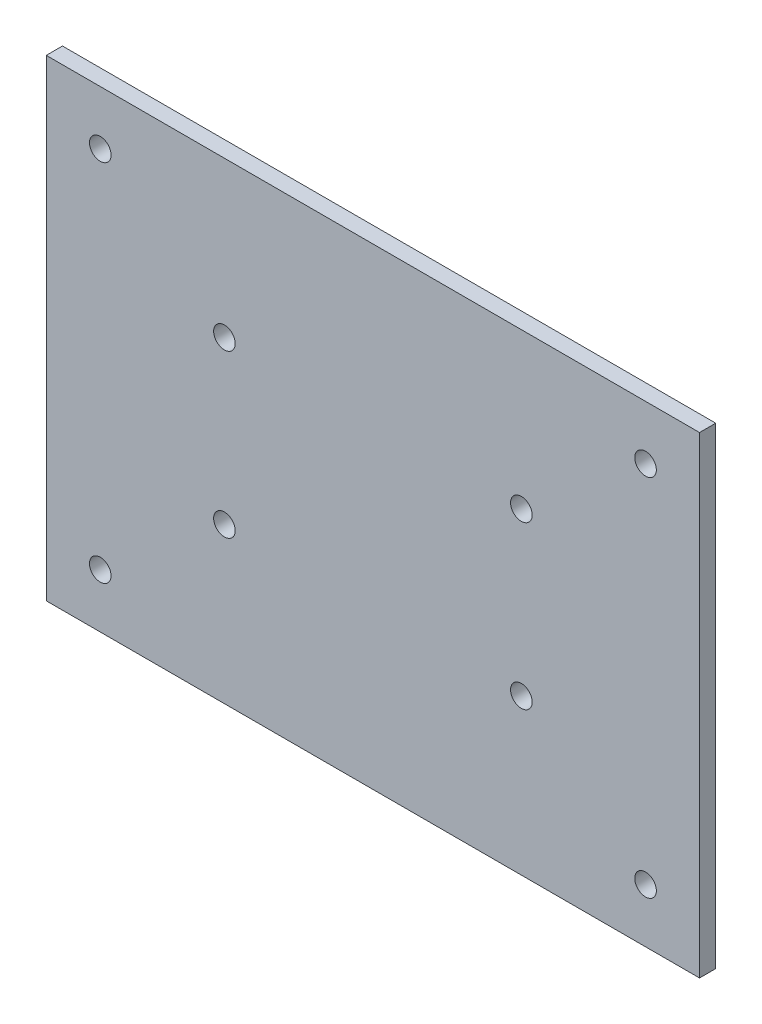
ISO-10303-21;
HEADER;
FILE_DESCRIPTION(('STEP AP214'),'2;1');
FILE_NAME('part.step','',(''),(''),'','','');
FILE_SCHEMA(('AUTOMOTIVE_DESIGN { 1 0 10303 214 1 1 1 1 }'));
ENDSEC;
DATA;
#1=APPLICATION_CONTEXT('core data for automotive mechanical design processes');
#2=APPLICATION_PROTOCOL_DEFINITION('international standard','automotive_design',2000,#1);
#3=PRODUCT_CONTEXT('',#1,'mechanical');
#4=PRODUCT('Part','Part','',(#3));
#5=PRODUCT_RELATED_PRODUCT_CATEGORY('part','',(#4));
#6=PRODUCT_DEFINITION_FORMATION('','',#4);
#7=PRODUCT_DEFINITION_CONTEXT('part definition',#1,'design');
#8=PRODUCT_DEFINITION('design','',#6,#7);
#9=PRODUCT_DEFINITION_SHAPE('','',#8);
#10=(LENGTH_UNIT() NAMED_UNIT(*) SI_UNIT(.MILLI.,.METRE.));
#11=(NAMED_UNIT(*) PLANE_ANGLE_UNIT() SI_UNIT($,.RADIAN.));
#12=(NAMED_UNIT(*) SI_UNIT($,.STERADIAN.) SOLID_ANGLE_UNIT());
#13=UNCERTAINTY_MEASURE_WITH_UNIT(LENGTH_MEASURE(1.E-05),#10,'distance_accuracy_value','');
#14=(GEOMETRIC_REPRESENTATION_CONTEXT(3) GLOBAL_UNCERTAINTY_ASSIGNED_CONTEXT((#13)) GLOBAL_UNIT_ASSIGNED_CONTEXT((#10,
#11,#12)) REPRESENTATION_CONTEXT('',''));
#15=CARTESIAN_POINT('',(0.,0.,0.));
#16=DIRECTION('',(0.,0.,1.));
#17=DIRECTION('',(1.,0.,0.));
#18=AXIS2_PLACEMENT_3D('',#15,#16,#17);
#19=CARTESIAN_POINT('',(60.5,43.75,3.));
#20=DIRECTION('',(-1.,0.,0.));
#21=DIRECTION('',(0.,-1.,0.));
#22=AXIS2_PLACEMENT_3D('',#19,#20,#21);
#23=PLANE('',#22);
#24=DIRECTION('',(0.,1.,0.));
#25=VECTOR('',#24,1.);
#26=CARTESIAN_POINT('',(60.5,43.75,0.));
#27=LINE('',#26,#25);
#28=CARTESIAN_POINT('',(60.5,-43.75,0.));
#29=VERTEX_POINT('',#28);
#30=CARTESIAN_POINT('',(60.5,43.75,0.));
#31=VERTEX_POINT('',#30);
#32=EDGE_CURVE('E98',#29,#31,#27,.T.);
#33=ORIENTED_EDGE('',*,*,#32,.T.);
#34=DIRECTION('',(0.,0.,-1.));
#35=VECTOR('',#34,1.);
#36=CARTESIAN_POINT('',(60.5,43.75,3.));
#37=LINE('',#36,#35);
#38=CARTESIAN_POINT('',(60.5,43.75,3.));
#39=VERTEX_POINT('',#38);
#40=EDGE_CURVE('E11',#39,#31,#37,.T.);
#41=ORIENTED_EDGE('',*,*,#40,.F.);
#42=DIRECTION('',(0.,1.,0.));
#43=VECTOR('',#42,1.);
#44=CARTESIAN_POINT('',(60.5,43.75,3.));
#45=LINE('',#44,#43);
#46=CARTESIAN_POINT('',(60.5,-43.75,3.));
#47=VERTEX_POINT('',#46);
#48=EDGE_CURVE('E86',#47,#39,#45,.T.);
#49=ORIENTED_EDGE('',*,*,#48,.F.);
#50=DIRECTION('',(0.,0.,-1.));
#51=VECTOR('',#50,1.);
#52=CARTESIAN_POINT('',(60.5,-43.75,3.));
#53=LINE('',#52,#51);
#54=EDGE_CURVE('E94',#47,#29,#53,.T.);
#55=ORIENTED_EDGE('',*,*,#54,.T.);
#56=EDGE_LOOP('',(#33,#41,#49,#55));
#57=FACE_BOUND('',#56,.T.);
#58=ADVANCED_FACE('F35',(#57),#23,.F.);
#59=CARTESIAN_POINT('',(-60.5,43.75,3.));
#60=DIRECTION('',(0.,-1.,0.));
#61=DIRECTION('',(0.,0.,-1.));
#62=AXIS2_PLACEMENT_3D('',#59,#60,#61);
#63=PLANE('',#62);
#64=DIRECTION('',(-1.,0.,0.));
#65=VECTOR('',#64,1.);
#66=CARTESIAN_POINT('',(-60.5,43.75,0.));
#67=LINE('',#66,#65);
#68=CARTESIAN_POINT('',(-60.5,43.75,0.));
#69=VERTEX_POINT('',#68);
#70=EDGE_CURVE('E90',#31,#69,#67,.T.);
#71=ORIENTED_EDGE('',*,*,#70,.T.);
#72=DIRECTION('',(0.,0.,-1.));
#73=VECTOR('',#72,1.);
#74=CARTESIAN_POINT('',(-60.5,43.75,3.));
#75=LINE('',#74,#73);
#76=CARTESIAN_POINT('',(-60.5,43.75,3.));
#77=VERTEX_POINT('',#76);
#78=EDGE_CURVE('E43',#77,#69,#75,.T.);
#79=ORIENTED_EDGE('',*,*,#78,.F.);
#80=DIRECTION('',(-1.,0.,0.));
#81=VECTOR('',#80,1.);
#82=CARTESIAN_POINT('',(-60.5,43.75,3.));
#83=LINE('',#82,#81);
#84=EDGE_CURVE('E81',#39,#77,#83,.T.);
#85=ORIENTED_EDGE('',*,*,#84,.F.);
#86=ORIENTED_EDGE('',*,*,#40,.T.);
#87=EDGE_LOOP('',(#71,#79,#85,#86));
#88=FACE_BOUND('',#87,.T.);
#89=ADVANCED_FACE('F89',(#88),#63,.F.);
#90=CARTESIAN_POINT('',(-60.5,43.75,3.));
#91=DIRECTION('',(1.,0.,0.));
#92=DIRECTION('',(0.,1.,0.));
#93=AXIS2_PLACEMENT_3D('',#90,#91,#92);
#94=PLANE('',#93);
#95=DIRECTION('',(0.,-1.,0.));
#96=VECTOR('',#95,1.);
#97=CARTESIAN_POINT('',(-60.5,43.75,0.));
#98=LINE('',#97,#96);
#99=CARTESIAN_POINT('',(-60.5,-43.75,0.));
#100=VERTEX_POINT('',#99);
#101=EDGE_CURVE('E68',#69,#100,#98,.T.);
#102=ORIENTED_EDGE('',*,*,#101,.T.);
#103=DIRECTION('',(0.,0.,-1.));
#104=VECTOR('',#103,1.);
#105=CARTESIAN_POINT('',(-60.5,-43.75,3.));
#106=LINE('',#105,#104);
#107=CARTESIAN_POINT('',(-60.5,-43.75,3.));
#108=VERTEX_POINT('',#107);
#109=EDGE_CURVE('E91',#108,#100,#106,.T.);
#110=ORIENTED_EDGE('',*,*,#109,.F.);
#111=DIRECTION('',(0.,-1.,0.));
#112=VECTOR('',#111,1.);
#113=CARTESIAN_POINT('',(-60.5,43.75,3.));
#114=LINE('',#113,#112);
#115=EDGE_CURVE('E84',#77,#108,#114,.T.);
#116=ORIENTED_EDGE('',*,*,#115,.F.);
#117=ORIENTED_EDGE('',*,*,#78,.T.);
#118=EDGE_LOOP('',(#102,#110,#116,#117));
#119=FACE_BOUND('',#118,.T.);
#120=ADVANCED_FACE('F92',(#119),#94,.F.);
#121=CARTESIAN_POINT('',(-60.5,-43.75,3.));
#122=DIRECTION('',(0.,1.,0.));
#123=DIRECTION('',(0.,0.,1.));
#124=AXIS2_PLACEMENT_3D('',#121,#122,#123);
#125=PLANE('',#124);
#126=DIRECTION('',(1.,0.,0.));
#127=VECTOR('',#126,1.);
#128=CARTESIAN_POINT('',(-60.5,-43.75,0.));
#129=LINE('',#128,#127);
#130=EDGE_CURVE('E74',#100,#29,#129,.T.);
#131=ORIENTED_EDGE('',*,*,#130,.T.);
#132=ORIENTED_EDGE('',*,*,#54,.F.);
#133=DIRECTION('',(1.,0.,0.));
#134=VECTOR('',#133,1.);
#135=CARTESIAN_POINT('',(-60.5,-43.75,3.));
#136=LINE('',#135,#134);
#137=EDGE_CURVE('E51',#108,#47,#136,.T.);
#138=ORIENTED_EDGE('',*,*,#137,.F.);
#139=ORIENTED_EDGE('',*,*,#109,.T.);
#140=EDGE_LOOP('',(#131,#132,#138,#139));
#141=FACE_BOUND('',#140,.T.);
#142=ADVANCED_FACE('F106',(#141),#125,.F.);
#143=CARTESIAN_POINT('',(0.,0.,3.));
#144=DIRECTION('',(0.,0.,1.));
#145=DIRECTION('',(1.,0.,0.));
#146=AXIS2_PLACEMENT_3D('',#143,#144,#145);
#147=PLANE('',#146);
#148=CARTESIAN_POINT('',(-50.5,33.75,3.));
#149=DIRECTION('',(0.,0.,1.));
#150=DIRECTION('',(1.,0.,0.));
#151=AXIS2_PLACEMENT_3D('',#148,#149,#150);
#152=CIRCLE('',#151,1.99999999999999);
#153=CARTESIAN_POINT('',(-48.5,33.75,3.));
#154=VERTEX_POINT('',#153);
#155=EDGE_CURVE('E156',#154,#154,#152,.T.);
#156=ORIENTED_EDGE('',*,*,#155,.F.);
#157=EDGE_LOOP('',(#156));
#158=FACE_BOUND('',#157,.T.);
#159=CARTESIAN_POINT('',(-50.5,-33.75,3.));
#160=DIRECTION('',(0.,0.,1.));
#161=DIRECTION('',(1.,0.,0.));
#162=AXIS2_PLACEMENT_3D('',#159,#160,#161);
#163=CIRCLE('',#162,1.99999999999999);
#164=CARTESIAN_POINT('',(-48.5,-33.75,3.));
#165=VERTEX_POINT('',#164);
#166=EDGE_CURVE('E150',#165,#165,#163,.T.);
#167=ORIENTED_EDGE('',*,*,#166,.F.);
#168=EDGE_LOOP('',(#167));
#169=FACE_BOUND('',#168,.T.);
#170=CARTESIAN_POINT('',(50.5,33.75,3.));
#171=DIRECTION('',(0.,0.,1.));
#172=DIRECTION('',(1.,0.,0.));
#173=AXIS2_PLACEMENT_3D('',#170,#171,#172);
#174=CIRCLE('',#173,1.99999999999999);
#175=CARTESIAN_POINT('',(52.5,33.75,3.));
#176=VERTEX_POINT('',#175);
#177=EDGE_CURVE('E144',#176,#176,#174,.T.);
#178=ORIENTED_EDGE('',*,*,#177,.F.);
#179=EDGE_LOOP('',(#178));
#180=FACE_BOUND('',#179,.T.);
#181=CARTESIAN_POINT('',(50.5,-33.75,3.));
#182=DIRECTION('',(0.,0.,1.));
#183=DIRECTION('',(1.,0.,0.));
#184=AXIS2_PLACEMENT_3D('',#181,#182,#183);
#185=CIRCLE('',#184,1.99999999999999);
#186=CARTESIAN_POINT('',(52.5,-33.75,3.));
#187=VERTEX_POINT('',#186);
#188=EDGE_CURVE('E138',#187,#187,#185,.T.);
#189=ORIENTED_EDGE('',*,*,#188,.F.);
#190=EDGE_LOOP('',(#189));
#191=FACE_BOUND('',#190,.T.);
#192=CARTESIAN_POINT('',(-27.5,15.,3.));
#193=DIRECTION('',(0.,0.,1.));
#194=DIRECTION('',(1.,0.,0.));
#195=AXIS2_PLACEMENT_3D('',#192,#193,#194);
#196=CIRCLE('',#195,1.99999999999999);
#197=CARTESIAN_POINT('',(-25.5,15.,3.));
#198=VERTEX_POINT('',#197);
#199=EDGE_CURVE('E132',#198,#198,#196,.T.);
#200=ORIENTED_EDGE('',*,*,#199,.F.);
#201=EDGE_LOOP('',(#200));
#202=FACE_BOUND('',#201,.T.);
#203=CARTESIAN_POINT('',(-27.5,-15.,3.));
#204=DIRECTION('',(0.,0.,1.));
#205=DIRECTION('',(1.,0.,0.));
#206=AXIS2_PLACEMENT_3D('',#203,#204,#205);
#207=CIRCLE('',#206,1.99999999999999);
#208=CARTESIAN_POINT('',(-25.5,-15.,3.));
#209=VERTEX_POINT('',#208);
#210=EDGE_CURVE('E126',#209,#209,#207,.T.);
#211=ORIENTED_EDGE('',*,*,#210,.F.);
#212=EDGE_LOOP('',(#211));
#213=FACE_BOUND('',#212,.T.);
#214=CARTESIAN_POINT('',(27.5,15.,3.));
#215=DIRECTION('',(0.,0.,1.));
#216=DIRECTION('',(1.,0.,0.));
#217=AXIS2_PLACEMENT_3D('',#214,#215,#216);
#218=CIRCLE('',#217,1.99999999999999);
#219=CARTESIAN_POINT('',(29.5,15.,3.));
#220=VERTEX_POINT('',#219);
#221=EDGE_CURVE('E120',#220,#220,#218,.T.);
#222=ORIENTED_EDGE('',*,*,#221,.F.);
#223=EDGE_LOOP('',(#222));
#224=FACE_BOUND('',#223,.T.);
#225=CARTESIAN_POINT('',(27.5,-15.,3.));
#226=DIRECTION('',(0.,0.,1.));
#227=DIRECTION('',(1.,0.,0.));
#228=AXIS2_PLACEMENT_3D('',#225,#226,#227);
#229=CIRCLE('',#228,1.99999999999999);
#230=CARTESIAN_POINT('',(29.5,-15.,3.));
#231=VERTEX_POINT('',#230);
#232=EDGE_CURVE('E114',#231,#231,#229,.T.);
#233=ORIENTED_EDGE('',*,*,#232,.F.);
#234=EDGE_LOOP('',(#233));
#235=FACE_BOUND('',#234,.T.);
#236=ORIENTED_EDGE('',*,*,#48,.T.);
#237=ORIENTED_EDGE('',*,*,#84,.T.);
#238=ORIENTED_EDGE('',*,*,#115,.T.);
#239=ORIENTED_EDGE('',*,*,#137,.T.);
#240=EDGE_LOOP('',(#236,#237,#238,#239));
#241=FACE_BOUND('',#240,.T.);
#242=ADVANCED_FACE('F82',(#158,#169,#180,#191,#202,#213,#224,#235,#241),#147,.T.);
#243=CARTESIAN_POINT('',(0.,0.,0.));
#244=DIRECTION('',(0.,0.,1.));
#245=DIRECTION('',(1.,0.,0.));
#246=AXIS2_PLACEMENT_3D('',#243,#244,#245);
#247=PLANE('',#246);
#248=CARTESIAN_POINT('',(-50.5,33.75,0.));
#249=DIRECTION('',(0.,0.,1.));
#250=DIRECTION('',(1.,0.,0.));
#251=AXIS2_PLACEMENT_3D('',#248,#249,#250);
#252=CIRCLE('',#251,1.99999999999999);
#253=CARTESIAN_POINT('',(-48.5,33.75,0.));
#254=VERTEX_POINT('',#253);
#255=EDGE_CURVE('E153',#254,#254,#252,.T.);
#256=ORIENTED_EDGE('',*,*,#255,.T.);
#257=EDGE_LOOP('',(#256));
#258=FACE_BOUND('',#257,.T.);
#259=CARTESIAN_POINT('',(-50.5,-33.75,0.));
#260=DIRECTION('',(0.,0.,1.));
#261=DIRECTION('',(1.,0.,0.));
#262=AXIS2_PLACEMENT_3D('',#259,#260,#261);
#263=CIRCLE('',#262,1.99999999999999);
#264=CARTESIAN_POINT('',(-48.5,-33.75,0.));
#265=VERTEX_POINT('',#264);
#266=EDGE_CURVE('E147',#265,#265,#263,.T.);
#267=ORIENTED_EDGE('',*,*,#266,.T.);
#268=EDGE_LOOP('',(#267));
#269=FACE_BOUND('',#268,.T.);
#270=CARTESIAN_POINT('',(50.5,33.75,0.));
#271=DIRECTION('',(0.,0.,1.));
#272=DIRECTION('',(1.,0.,0.));
#273=AXIS2_PLACEMENT_3D('',#270,#271,#272);
#274=CIRCLE('',#273,1.99999999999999);
#275=CARTESIAN_POINT('',(52.5,33.75,0.));
#276=VERTEX_POINT('',#275);
#277=EDGE_CURVE('E141',#276,#276,#274,.T.);
#278=ORIENTED_EDGE('',*,*,#277,.T.);
#279=EDGE_LOOP('',(#278));
#280=FACE_BOUND('',#279,.T.);
#281=CARTESIAN_POINT('',(50.5,-33.75,0.));
#282=DIRECTION('',(0.,0.,1.));
#283=DIRECTION('',(1.,0.,0.));
#284=AXIS2_PLACEMENT_3D('',#281,#282,#283);
#285=CIRCLE('',#284,1.99999999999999);
#286=CARTESIAN_POINT('',(52.5,-33.75,0.));
#287=VERTEX_POINT('',#286);
#288=EDGE_CURVE('E135',#287,#287,#285,.T.);
#289=ORIENTED_EDGE('',*,*,#288,.T.);
#290=EDGE_LOOP('',(#289));
#291=FACE_BOUND('',#290,.T.);
#292=CARTESIAN_POINT('',(-27.5,15.,0.));
#293=DIRECTION('',(0.,0.,1.));
#294=DIRECTION('',(1.,0.,0.));
#295=AXIS2_PLACEMENT_3D('',#292,#293,#294);
#296=CIRCLE('',#295,2.);
#297=CARTESIAN_POINT('',(-25.5,15.,0.));
#298=VERTEX_POINT('',#297);
#299=EDGE_CURVE('E129',#298,#298,#296,.T.);
#300=ORIENTED_EDGE('',*,*,#299,.T.);
#301=EDGE_LOOP('',(#300));
#302=FACE_BOUND('',#301,.T.);
#303=CARTESIAN_POINT('',(-27.5,-15.,0.));
#304=DIRECTION('',(0.,0.,1.));
#305=DIRECTION('',(1.,0.,0.));
#306=AXIS2_PLACEMENT_3D('',#303,#304,#305);
#307=CIRCLE('',#306,2.);
#308=CARTESIAN_POINT('',(-25.5,-15.,0.));
#309=VERTEX_POINT('',#308);
#310=EDGE_CURVE('E123',#309,#309,#307,.T.);
#311=ORIENTED_EDGE('',*,*,#310,.T.);
#312=EDGE_LOOP('',(#311));
#313=FACE_BOUND('',#312,.T.);
#314=CARTESIAN_POINT('',(27.5,15.,0.));
#315=DIRECTION('',(0.,0.,1.));
#316=DIRECTION('',(1.,0.,0.));
#317=AXIS2_PLACEMENT_3D('',#314,#315,#316);
#318=CIRCLE('',#317,2.);
#319=CARTESIAN_POINT('',(29.5,15.,0.));
#320=VERTEX_POINT('',#319);
#321=EDGE_CURVE('E117',#320,#320,#318,.T.);
#322=ORIENTED_EDGE('',*,*,#321,.T.);
#323=EDGE_LOOP('',(#322));
#324=FACE_BOUND('',#323,.T.);
#325=CARTESIAN_POINT('',(27.5,-15.,0.));
#326=DIRECTION('',(0.,0.,1.));
#327=DIRECTION('',(1.,0.,0.));
#328=AXIS2_PLACEMENT_3D('',#325,#326,#327);
#329=CIRCLE('',#328,2.);
#330=CARTESIAN_POINT('',(29.5,-15.,0.));
#331=VERTEX_POINT('',#330);
#332=EDGE_CURVE('E101',#331,#331,#329,.T.);
#333=ORIENTED_EDGE('',*,*,#332,.T.);
#334=EDGE_LOOP('',(#333));
#335=FACE_BOUND('',#334,.T.);
#336=ORIENTED_EDGE('',*,*,#32,.F.);
#337=ORIENTED_EDGE('',*,*,#130,.F.);
#338=ORIENTED_EDGE('',*,*,#101,.F.);
#339=ORIENTED_EDGE('',*,*,#70,.F.);
#340=EDGE_LOOP('',(#336,#337,#338,#339));
#341=FACE_BOUND('',#340,.T.);
#342=ADVANCED_FACE('F109',(#258,#269,#280,#291,#302,#313,#324,#335,#341),#247,.F.);
#343=CARTESIAN_POINT('',(27.5,-15.,3.));
#344=DIRECTION('',(0.,0.,1.));
#345=DIRECTION('',(1.,0.,0.));
#346=AXIS2_PLACEMENT_3D('',#343,#344,#345);
#347=CYLINDRICAL_SURFACE('',#346,1.99999999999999);
#348=ORIENTED_EDGE('',*,*,#332,.F.);
#349=EDGE_LOOP('',(#348));
#350=FACE_BOUND('',#349,.T.);
#351=ORIENTED_EDGE('',*,*,#232,.T.);
#352=EDGE_LOOP('',(#351));
#353=FACE_BOUND('',#352,.T.);
#354=ADVANCED_FACE('F179',(#350,#353),#347,.F.);
#355=CARTESIAN_POINT('',(27.5,15.,3.));
#356=DIRECTION('',(0.,0.,1.));
#357=DIRECTION('',(1.,0.,0.));
#358=AXIS2_PLACEMENT_3D('',#355,#356,#357);
#359=CYLINDRICAL_SURFACE('',#358,1.99999999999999);
#360=ORIENTED_EDGE('',*,*,#321,.F.);
#361=EDGE_LOOP('',(#360));
#362=FACE_BOUND('',#361,.T.);
#363=ORIENTED_EDGE('',*,*,#221,.T.);
#364=EDGE_LOOP('',(#363));
#365=FACE_BOUND('',#364,.T.);
#366=ADVANCED_FACE('F181',(#362,#365),#359,.F.);
#367=CARTESIAN_POINT('',(-27.5,-15.,3.));
#368=DIRECTION('',(0.,0.,1.));
#369=DIRECTION('',(1.,0.,0.));
#370=AXIS2_PLACEMENT_3D('',#367,#368,#369);
#371=CYLINDRICAL_SURFACE('',#370,1.99999999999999);
#372=ORIENTED_EDGE('',*,*,#310,.F.);
#373=EDGE_LOOP('',(#372));
#374=FACE_BOUND('',#373,.T.);
#375=ORIENTED_EDGE('',*,*,#210,.T.);
#376=EDGE_LOOP('',(#375));
#377=FACE_BOUND('',#376,.T.);
#378=ADVANCED_FACE('F188',(#374,#377),#371,.F.);
#379=CARTESIAN_POINT('',(-27.5,15.,3.));
#380=DIRECTION('',(0.,0.,1.));
#381=DIRECTION('',(1.,0.,0.));
#382=AXIS2_PLACEMENT_3D('',#379,#380,#381);
#383=CYLINDRICAL_SURFACE('',#382,1.99999999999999);
#384=ORIENTED_EDGE('',*,*,#299,.F.);
#385=EDGE_LOOP('',(#384));
#386=FACE_BOUND('',#385,.T.);
#387=ORIENTED_EDGE('',*,*,#199,.T.);
#388=EDGE_LOOP('',(#387));
#389=FACE_BOUND('',#388,.T.);
#390=ADVANCED_FACE('F231',(#386,#389),#383,.F.);
#391=CARTESIAN_POINT('',(50.5,-33.75,3.));
#392=DIRECTION('',(0.,0.,1.));
#393=DIRECTION('',(1.,0.,0.));
#394=AXIS2_PLACEMENT_3D('',#391,#392,#393);
#395=CYLINDRICAL_SURFACE('',#394,1.99999999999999);
#396=ORIENTED_EDGE('',*,*,#288,.F.);
#397=EDGE_LOOP('',(#396));
#398=FACE_BOUND('',#397,.T.);
#399=ORIENTED_EDGE('',*,*,#188,.T.);
#400=EDGE_LOOP('',(#399));
#401=FACE_BOUND('',#400,.T.);
#402=ADVANCED_FACE('F225',(#398,#401),#395,.F.);
#403=CARTESIAN_POINT('',(50.5,33.75,3.));
#404=DIRECTION('',(0.,0.,1.));
#405=DIRECTION('',(1.,0.,0.));
#406=AXIS2_PLACEMENT_3D('',#403,#404,#405);
#407=CYLINDRICAL_SURFACE('',#406,1.99999999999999);
#408=ORIENTED_EDGE('',*,*,#277,.F.);
#409=EDGE_LOOP('',(#408));
#410=FACE_BOUND('',#409,.T.);
#411=ORIENTED_EDGE('',*,*,#177,.T.);
#412=EDGE_LOOP('',(#411));
#413=FACE_BOUND('',#412,.T.);
#414=ADVANCED_FACE('F230',(#410,#413),#407,.F.);
#415=CARTESIAN_POINT('',(-50.5,-33.75,3.));
#416=DIRECTION('',(0.,0.,1.));
#417=DIRECTION('',(1.,0.,0.));
#418=AXIS2_PLACEMENT_3D('',#415,#416,#417);
#419=CYLINDRICAL_SURFACE('',#418,1.99999999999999);
#420=ORIENTED_EDGE('',*,*,#266,.F.);
#421=EDGE_LOOP('',(#420));
#422=FACE_BOUND('',#421,.T.);
#423=ORIENTED_EDGE('',*,*,#166,.T.);
#424=EDGE_LOOP('',(#423));
#425=FACE_BOUND('',#424,.T.);
#426=ADVANCED_FACE('F243',(#422,#425),#419,.F.);
#427=CARTESIAN_POINT('',(-50.5,33.75,3.));
#428=DIRECTION('',(0.,0.,1.));
#429=DIRECTION('',(1.,0.,0.));
#430=AXIS2_PLACEMENT_3D('',#427,#428,#429);
#431=CYLINDRICAL_SURFACE('',#430,1.99999999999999);
#432=ORIENTED_EDGE('',*,*,#255,.F.);
#433=EDGE_LOOP('',(#432));
#434=FACE_BOUND('',#433,.T.);
#435=ORIENTED_EDGE('',*,*,#155,.T.);
#436=EDGE_LOOP('',(#435));
#437=FACE_BOUND('',#436,.T.);
#438=ADVANCED_FACE('F160',(#434,#437),#431,.F.);
#439=CLOSED_SHELL('',(#58,#89,#120,#142,#242,#342,#354,#366,#378,#390,#402,#414,#426,#438));
#440=MANIFOLD_SOLID_BREP('B2',#439);
#441=ADVANCED_BREP_SHAPE_REPRESENTATION('',(#18,#440),#14);
#442=SHAPE_DEFINITION_REPRESENTATION(#9,#441);
ENDSEC;
END-ISO-10303-21;
